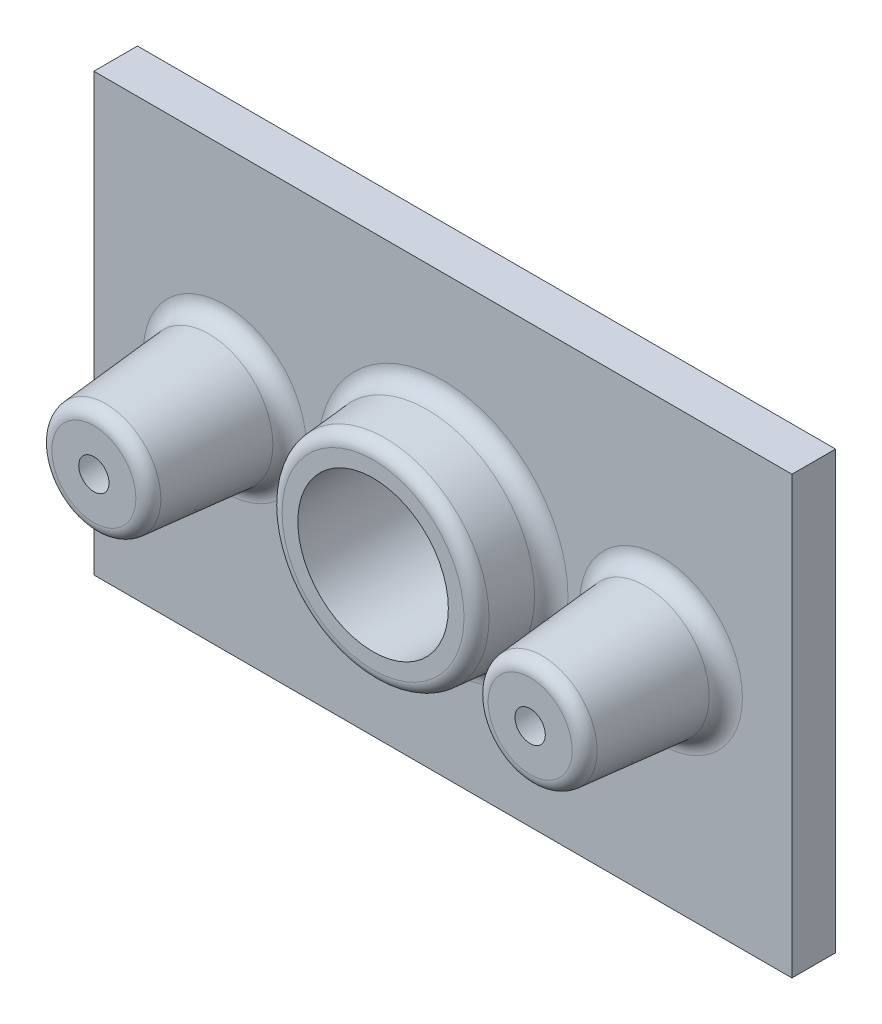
ISO-10303-21;
HEADER;
FILE_DESCRIPTION(('STEP AP214'),'2;1');
FILE_NAME('part.step','',(''),(''),'','','');
FILE_SCHEMA(('AUTOMOTIVE_DESIGN { 1 0 10303 214 1 1 1 1 }'));
ENDSEC;
DATA;
#1=APPLICATION_CONTEXT('core data for automotive mechanical design processes');
#2=APPLICATION_PROTOCOL_DEFINITION('international standard','automotive_design',2000,#1);
#3=PRODUCT_CONTEXT('',#1,'mechanical');
#4=PRODUCT('Part','Part','',(#3));
#5=PRODUCT_RELATED_PRODUCT_CATEGORY('part','',(#4));
#6=PRODUCT_DEFINITION_FORMATION('','',#4);
#7=PRODUCT_DEFINITION_CONTEXT('part definition',#1,'design');
#8=PRODUCT_DEFINITION('design','',#6,#7);
#9=PRODUCT_DEFINITION_SHAPE('','',#8);
#10=(LENGTH_UNIT() NAMED_UNIT(*) SI_UNIT(.MILLI.,.METRE.));
#11=(NAMED_UNIT(*) PLANE_ANGLE_UNIT() SI_UNIT($,.RADIAN.));
#12=(NAMED_UNIT(*) SI_UNIT($,.STERADIAN.) SOLID_ANGLE_UNIT());
#13=UNCERTAINTY_MEASURE_WITH_UNIT(LENGTH_MEASURE(1.E-05),#10,'distance_accuracy_value','');
#14=(GEOMETRIC_REPRESENTATION_CONTEXT(3) GLOBAL_UNCERTAINTY_ASSIGNED_CONTEXT((#13)) GLOBAL_UNIT_ASSIGNED_CONTEXT((#10,
#11,#12)) REPRESENTATION_CONTEXT('',''));
#15=CARTESIAN_POINT('',(0.,0.,0.));
#16=DIRECTION('',(0.,0.,1.));
#17=DIRECTION('',(1.,0.,0.));
#18=AXIS2_PLACEMENT_3D('',#15,#16,#17);
#19=CARTESIAN_POINT('',(-40.,25.,5.));
#20=DIRECTION('',(0.,0.,1.));
#21=DIRECTION('',(1.,0.,0.));
#22=AXIS2_PLACEMENT_3D('',#19,#20,#21);
#23=PLANE('',#22);
#24=CARTESIAN_POINT('',(25.,0.,5.));
#25=DIRECTION('',(0.,0.,1.));
#26=DIRECTION('',(1.,0.,0.));
#27=AXIS2_PLACEMENT_3D('',#24,#25,#26);
#28=CIRCLE('',#27,9.33266234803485);
#29=CARTESIAN_POINT('',(34.3326623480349,0.,5.));
#30=VERTEX_POINT('',#29);
#31=EDGE_CURVE('E318',#30,#30,#28,.F.);
#32=ORIENTED_EDGE('',*,*,#31,.T.);
#33=EDGE_LOOP('',(#32));
#34=FACE_BOUND('',#33,.T.);
#35=CARTESIAN_POINT('',(0.,0.,5.));
#36=DIRECTION('',(0.,0.,1.));
#37=DIRECTION('',(1.,0.,0.));
#38=AXIS2_PLACEMENT_3D('',#35,#36,#37);
#39=CIRCLE('',#38,14.3326623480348);
#40=CARTESIAN_POINT('',(14.3326623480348,0.,5.));
#41=VERTEX_POINT('',#40);
#42=EDGE_CURVE('E315',#41,#41,#39,.F.);
#43=ORIENTED_EDGE('',*,*,#42,.T.);
#44=EDGE_LOOP('',(#43));
#45=FACE_BOUND('',#44,.T.);
#46=CARTESIAN_POINT('',(-25.,0.,5.));
#47=DIRECTION('',(0.,0.,1.));
#48=DIRECTION('',(1.,0.,0.));
#49=AXIS2_PLACEMENT_3D('',#46,#47,#48);
#50=CIRCLE('',#49,9.33266234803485);
#51=CARTESIAN_POINT('',(-15.6673376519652,0.,5.));
#52=VERTEX_POINT('',#51);
#53=EDGE_CURVE('E311',#52,#52,#50,.F.);
#54=ORIENTED_EDGE('',*,*,#53,.T.);
#55=EDGE_LOOP('',(#54));
#56=FACE_BOUND('',#55,.T.);
#57=DIRECTION('',(0.,-1.,0.));
#58=VECTOR('',#57,1.);
#59=CARTESIAN_POINT('',(-40.,25.,5.));
#60=LINE('',#59,#58);
#61=CARTESIAN_POINT('',(-40.,25.,5.));
#62=VERTEX_POINT('',#61);
#63=CARTESIAN_POINT('',(-40.,-25.,5.));
#64=VERTEX_POINT('',#63);
#65=EDGE_CURVE('E593',#62,#64,#60,.T.);
#66=ORIENTED_EDGE('',*,*,#65,.T.);
#67=DIRECTION('',(1.,0.,0.));
#68=VECTOR('',#67,1.);
#69=CARTESIAN_POINT('',(-40.,-25.,5.));
#70=LINE('',#69,#68);
#71=CARTESIAN_POINT('',(40.,-25.,5.));
#72=VERTEX_POINT('',#71);
#73=EDGE_CURVE('E596',#64,#72,#70,.T.);
#74=ORIENTED_EDGE('',*,*,#73,.T.);
#75=DIRECTION('',(0.,1.,0.));
#76=VECTOR('',#75,1.);
#77=CARTESIAN_POINT('',(40.,25.,5.));
#78=LINE('',#77,#76);
#79=CARTESIAN_POINT('',(40.,25.,5.));
#80=VERTEX_POINT('',#79);
#81=EDGE_CURVE('E599',#72,#80,#78,.T.);
#82=ORIENTED_EDGE('',*,*,#81,.T.);
#83=DIRECTION('',(-1.,0.,0.));
#84=VECTOR('',#83,1.);
#85=CARTESIAN_POINT('',(-40.,25.,5.));
#86=LINE('',#85,#84);
#87=EDGE_CURVE('E601',#80,#62,#86,.T.);
#88=ORIENTED_EDGE('',*,*,#87,.T.);
#89=EDGE_LOOP('',(#66,#74,#82,#88));
#90=FACE_BOUND('',#89,.T.);
#91=ADVANCED_FACE('F37',(#34,#45,#56,#90),#23,.T.);
#92=CARTESIAN_POINT('',(-40.,25.,0.));
#93=DIRECTION('',(0.,0.,1.));
#94=DIRECTION('',(1.,0.,0.));
#95=AXIS2_PLACEMENT_3D('',#92,#93,#94);
#96=PLANE('',#95);
#97=DIRECTION('',(-0.916515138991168,-0.4,0.));
#98=VECTOR('',#97,1.);
#99=CARTESIAN_POINT('',(-28.9591716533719,9.0716018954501,0.));
#100=LINE('',#99,#98);
#101=CARTESIAN_POINT('',(-7.9591716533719,18.2367532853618,0.));
#102=VERTEX_POINT('',#101);
#103=CARTESIAN_POINT('',(-28.9591716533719,9.0716018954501,0.));
#104=VERTEX_POINT('',#103);
#105=EDGE_CURVE('E348',#102,#104,#100,.T.);
#106=ORIENTED_EDGE('',*,*,#105,.T.);
#107=CARTESIAN_POINT('',(-25.,0.,0.));
#108=DIRECTION('',(0.,0.,1.));
#109=DIRECTION('',(1.,0.,0.));
#110=AXIS2_PLACEMENT_3D('',#107,#108,#109);
#111=CIRCLE('',#110,9.89792913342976);
#112=CARTESIAN_POINT('',(-28.9591716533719,-9.0716018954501,0.));
#113=VERTEX_POINT('',#112);
#114=EDGE_CURVE('E362',#104,#113,#111,.T.);
#115=ORIENTED_EDGE('',*,*,#114,.T.);
#116=DIRECTION('',(0.916515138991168,-0.4,0.));
#117=VECTOR('',#116,1.);
#118=CARTESIAN_POINT('',(-7.9591716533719,-18.2367532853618,0.));
#119=LINE('',#118,#117);
#120=CARTESIAN_POINT('',(-7.95917165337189,-18.2367532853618,0.));
#121=VERTEX_POINT('',#120);
#122=EDGE_CURVE('E360',#113,#121,#119,.T.);
#123=ORIENTED_EDGE('',*,*,#122,.T.);
#124=CARTESIAN_POINT('',(0.,0.,0.));
#125=DIRECTION('',(0.,0.,1.));
#126=DIRECTION('',(1.,0.,0.));
#127=AXIS2_PLACEMENT_3D('',#124,#125,#126);
#128=CIRCLE('',#127,19.8979291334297);
#129=CARTESIAN_POINT('',(7.9591716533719,-18.2367532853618,0.));
#130=VERTEX_POINT('',#129);
#131=EDGE_CURVE('E358',#121,#130,#128,.T.);
#132=ORIENTED_EDGE('',*,*,#131,.T.);
#133=DIRECTION('',(0.916515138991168,0.4,0.));
#134=VECTOR('',#133,1.);
#135=CARTESIAN_POINT('',(28.9591716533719,-9.07160189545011,0.));
#136=LINE('',#135,#134);
#137=CARTESIAN_POINT('',(28.9591716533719,-9.07160189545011,0.));
#138=VERTEX_POINT('',#137);
#139=EDGE_CURVE('E356',#130,#138,#136,.T.);
#140=ORIENTED_EDGE('',*,*,#139,.T.);
#141=CARTESIAN_POINT('',(25.,0.,0.));
#142=DIRECTION('',(0.,0.,1.));
#143=DIRECTION('',(1.,0.,0.));
#144=AXIS2_PLACEMENT_3D('',#141,#142,#143);
#145=CIRCLE('',#144,9.89792913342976);
#146=CARTESIAN_POINT('',(28.9591716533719,9.0716018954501,0.));
#147=VERTEX_POINT('',#146);
#148=EDGE_CURVE('E354',#138,#147,#145,.T.);
#149=ORIENTED_EDGE('',*,*,#148,.T.);
#150=DIRECTION('',(-0.916515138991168,0.4,0.));
#151=VECTOR('',#150,1.);
#152=CARTESIAN_POINT('',(7.95917165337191,18.2367532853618,0.));
#153=LINE('',#152,#151);
#154=CARTESIAN_POINT('',(7.9591716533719,18.2367532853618,0.));
#155=VERTEX_POINT('',#154);
#156=EDGE_CURVE('E352',#147,#155,#153,.T.);
#157=ORIENTED_EDGE('',*,*,#156,.T.);
#158=CARTESIAN_POINT('',(0.,0.,0.));
#159=DIRECTION('',(0.,0.,1.));
#160=DIRECTION('',(1.,0.,0.));
#161=AXIS2_PLACEMENT_3D('',#158,#159,#160);
#162=CIRCLE('',#161,19.8979291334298);
#163=EDGE_CURVE('E350',#155,#102,#162,.T.);
#164=ORIENTED_EDGE('',*,*,#163,.T.);
#165=EDGE_LOOP('',(#106,#115,#123,#132,#140,#149,#157,#164));
#166=FACE_BOUND('',#165,.T.);
#167=DIRECTION('',(0.,-1.,0.));
#168=VECTOR('',#167,1.);
#169=CARTESIAN_POINT('',(-40.,25.,0.));
#170=LINE('',#169,#168);
#171=CARTESIAN_POINT('',(-40.,25.,0.));
#172=VERTEX_POINT('',#171);
#173=CARTESIAN_POINT('',(-40.,-25.,0.));
#174=VERTEX_POINT('',#173);
#175=EDGE_CURVE('E604',#172,#174,#170,.T.);
#176=ORIENTED_EDGE('',*,*,#175,.F.);
#177=DIRECTION('',(-1.,0.,0.));
#178=VECTOR('',#177,1.);
#179=CARTESIAN_POINT('',(-40.,25.,0.));
#180=LINE('',#179,#178);
#181=CARTESIAN_POINT('',(40.,25.,0.));
#182=VERTEX_POINT('',#181);
#183=EDGE_CURVE('E597',#182,#172,#180,.T.);
#184=ORIENTED_EDGE('',*,*,#183,.F.);
#185=DIRECTION('',(0.,1.,0.));
#186=VECTOR('',#185,1.);
#187=CARTESIAN_POINT('',(40.,25.,0.));
#188=LINE('',#187,#186);
#189=CARTESIAN_POINT('',(40.,-25.,0.));
#190=VERTEX_POINT('',#189);
#191=EDGE_CURVE('E609',#190,#182,#188,.T.);
#192=ORIENTED_EDGE('',*,*,#191,.F.);
#193=DIRECTION('',(1.,0.,0.));
#194=VECTOR('',#193,1.);
#195=CARTESIAN_POINT('',(-40.,-25.,0.));
#196=LINE('',#195,#194);
#197=EDGE_CURVE('E607',#174,#190,#196,.T.);
#198=ORIENTED_EDGE('',*,*,#197,.F.);
#199=EDGE_LOOP('',(#176,#184,#192,#198));
#200=FACE_BOUND('',#199,.T.);
#201=ADVANCED_FACE('F435',(#166,#200),#96,.F.);
#202=CARTESIAN_POINT('',(-40.,25.,5.));
#203=DIRECTION('',(1.,0.,0.));
#204=DIRECTION('',(0.,1.,0.));
#205=AXIS2_PLACEMENT_3D('',#202,#203,#204);
#206=PLANE('',#205);
#207=ORIENTED_EDGE('',*,*,#175,.T.);
#208=DIRECTION('',(0.,0.,-1.));
#209=VECTOR('',#208,1.);
#210=CARTESIAN_POINT('',(-40.,-25.,5.));
#211=LINE('',#210,#209);
#212=EDGE_CURVE('E312',#64,#174,#211,.T.);
#213=ORIENTED_EDGE('',*,*,#212,.F.);
#214=ORIENTED_EDGE('',*,*,#65,.F.);
#215=DIRECTION('',(0.,0.,-1.));
#216=VECTOR('',#215,1.);
#217=CARTESIAN_POINT('',(-40.,25.,5.));
#218=LINE('',#217,#216);
#219=EDGE_CURVE('E603',#62,#172,#218,.T.);
#220=ORIENTED_EDGE('',*,*,#219,.T.);
#221=EDGE_LOOP('',(#207,#213,#214,#220));
#222=FACE_BOUND('',#221,.T.);
#223=ADVANCED_FACE('F441',(#222),#206,.F.);
#224=CARTESIAN_POINT('',(-40.,-25.,5.));
#225=DIRECTION('',(0.,1.,0.));
#226=DIRECTION('',(-1.,0.,0.));
#227=AXIS2_PLACEMENT_3D('',#224,#225,#226);
#228=PLANE('',#227);
#229=ORIENTED_EDGE('',*,*,#197,.T.);
#230=DIRECTION('',(0.,0.,-1.));
#231=VECTOR('',#230,1.);
#232=CARTESIAN_POINT('',(40.,-25.,5.));
#233=LINE('',#232,#231);
#234=EDGE_CURVE('E616',#72,#190,#233,.T.);
#235=ORIENTED_EDGE('',*,*,#234,.F.);
#236=ORIENTED_EDGE('',*,*,#73,.F.);
#237=ORIENTED_EDGE('',*,*,#212,.T.);
#238=EDGE_LOOP('',(#229,#235,#236,#237));
#239=FACE_BOUND('',#238,.T.);
#240=ADVANCED_FACE('F452',(#239),#228,.F.);
#241=CARTESIAN_POINT('',(40.,25.,5.));
#242=DIRECTION('',(-1.,0.,0.));
#243=DIRECTION('',(0.,0.,1.));
#244=AXIS2_PLACEMENT_3D('',#241,#242,#243);
#245=PLANE('',#244);
#246=ORIENTED_EDGE('',*,*,#191,.T.);
#247=DIRECTION('',(0.,0.,-1.));
#248=VECTOR('',#247,1.);
#249=CARTESIAN_POINT('',(40.,25.,5.));
#250=LINE('',#249,#248);
#251=EDGE_CURVE('E614',#80,#182,#250,.T.);
#252=ORIENTED_EDGE('',*,*,#251,.F.);
#253=ORIENTED_EDGE('',*,*,#81,.F.);
#254=ORIENTED_EDGE('',*,*,#234,.T.);
#255=EDGE_LOOP('',(#246,#252,#253,#254));
#256=FACE_BOUND('',#255,.T.);
#257=ADVANCED_FACE('F448',(#256),#245,.F.);
#258=CARTESIAN_POINT('',(-40.,25.,5.));
#259=DIRECTION('',(0.,-1.,0.));
#260=DIRECTION('',(0.,0.,-1.));
#261=AXIS2_PLACEMENT_3D('',#258,#259,#260);
#262=PLANE('',#261);
#263=ORIENTED_EDGE('',*,*,#183,.T.);
#264=ORIENTED_EDGE('',*,*,#219,.F.);
#265=ORIENTED_EDGE('',*,*,#87,.F.);
#266=ORIENTED_EDGE('',*,*,#251,.T.);
#267=EDGE_LOOP('',(#263,#264,#265,#266));
#268=FACE_BOUND('',#267,.T.);
#269=ADVANCED_FACE('F430',(#268),#262,.F.);
#270=CARTESIAN_POINT('',(0.,0.,5.));
#271=DIRECTION('',(0.,0.,-1.));
#272=DIRECTION('',(1.,0.,0.));
#273=AXIS2_PLACEMENT_3D('',#270,#271,#272);
#274=CONICAL_SURFACE('',#273,12.5,0.0872664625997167);
#275=CARTESIAN_POINT('',(0.,0.,11.6307336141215));
#276=DIRECTION('',(0.,0.,-1.));
#277=DIRECTION('',(-1.,0.,0.));
#278=AXIS2_PLACEMENT_3D('',#275,#276,#277);
#279=CIRCLE('',#278,11.9198859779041);
#280=CARTESIAN_POINT('',(-11.9198859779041,0.,11.6307336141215));
#281=VERTEX_POINT('',#280);
#282=EDGE_CURVE('E336',#281,#281,#279,.T.);
#283=ORIENTED_EDGE('',*,*,#282,.T.);
#284=EDGE_LOOP('',(#283));
#285=FACE_BOUND('',#284,.T.);
#286=CARTESIAN_POINT('',(0.,0.,6.82568851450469));
#287=DIRECTION('',(0.,0.,1.));
#288=DIRECTION('',(1.,0.,0.));
#289=AXIS2_PLACEMENT_3D('',#286,#287,#288);
#290=CIRCLE('',#289,12.3402729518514);
#291=CARTESIAN_POINT('',(12.3402729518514,0.,6.82568851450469));
#292=VERTEX_POINT('',#291);
#293=EDGE_CURVE('E321',#292,#292,#290,.T.);
#294=ORIENTED_EDGE('',*,*,#293,.T.);
#295=EDGE_LOOP('',(#294));
#296=FACE_BOUND('',#295,.T.);
#297=ADVANCED_FACE('F421',(#285,#296),#274,.T.);
#298=CARTESIAN_POINT('',(0.,0.,13.));
#299=DIRECTION('',(0.,0.,1.));
#300=DIRECTION('',(1.,0.,0.));
#301=AXIS2_PLACEMENT_3D('',#298,#299,#300);
#302=PLANE('',#301);
#303=CARTESIAN_POINT('',(0.,0.,13.));
#304=DIRECTION('',(0.,0.,1.));
#305=DIRECTION('',(1.,0.,0.));
#306=AXIS2_PLACEMENT_3D('',#303,#304,#305);
#307=CIRCLE('',#306,10.4255939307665);
#308=CARTESIAN_POINT('',(10.4255939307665,0.,13.));
#309=VERTEX_POINT('',#308);
#310=EDGE_CURVE('E333',#309,#309,#307,.T.);
#311=ORIENTED_EDGE('',*,*,#310,.T.);
#312=EDGE_LOOP('',(#311));
#313=FACE_BOUND('',#312,.T.);
#314=CARTESIAN_POINT('',(0.,0.,13.));
#315=DIRECTION('',(0.,0.,1.));
#316=DIRECTION('',(1.,0.,0.));
#317=AXIS2_PLACEMENT_3D('',#314,#315,#316);
#318=CIRCLE('',#317,8.625);
#319=CARTESIAN_POINT('',(8.625,0.,13.));
#320=VERTEX_POINT('',#319);
#321=EDGE_CURVE('E258',#320,#320,#318,.T.);
#322=ORIENTED_EDGE('',*,*,#321,.F.);
#323=EDGE_LOOP('',(#322));
#324=FACE_BOUND('',#323,.T.);
#325=ADVANCED_FACE('F418',(#313,#324),#302,.T.);
#326=CARTESIAN_POINT('',(0.,0.,0.));
#327=DIRECTION('',(0.,0.,1.));
#328=DIRECTION('',(-1.,0.,0.));
#329=AXIS2_PLACEMENT_3D('',#326,#327,#328);
#330=CONICAL_SURFACE('',#329,18.,0.05235987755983);
#331=DIRECTION('',(-0.0209343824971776,0.0479666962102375,0.998629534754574));
#332=VECTOR('',#331,1.);
#333=CARTESIAN_POINT('',(-7.2,16.497272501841,0.));
#334=LINE('',#333,#332);
#335=CARTESIAN_POINT('',(-7.13711066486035,16.3531749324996,-3.));
#336=VERTEX_POINT('',#335);
#337=CARTESIAN_POINT('',(-7.16026802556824,16.4062351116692,-1.89532808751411));
#338=VERTEX_POINT('',#337);
#339=EDGE_CURVE('E592',#336,#338,#334,.T.);
#340=ORIENTED_EDGE('',*,*,#339,.T.);
#341=CARTESIAN_POINT('',(0.,0.,-1.89532808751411));
#342=DIRECTION('',(0.,0.,1.));
#343=DIRECTION('',(1.,0.,0.));
#344=AXIS2_PLACEMENT_3D('',#341,#342,#343);
#345=CIRCLE('',#344,17.9006700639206);
#346=CARTESIAN_POINT('',(7.16026802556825,16.4062351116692,-1.89532808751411));
#347=VERTEX_POINT('',#346);
#348=EDGE_CURVE('E61',#338,#347,#345,.F.);
#349=ORIENTED_EDGE('',*,*,#348,.T.);
#350=DIRECTION('',(0.0209343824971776,0.0479666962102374,0.998629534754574));
#351=VECTOR('',#350,1.);
#352=CARTESIAN_POINT('',(7.2,16.497272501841,0.));
#353=LINE('',#352,#351);
#354=CARTESIAN_POINT('',(7.13711066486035,16.3531749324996,-3.));
#355=VERTEX_POINT('',#354);
#356=EDGE_CURVE('E563',#355,#347,#353,.T.);
#357=ORIENTED_EDGE('',*,*,#356,.F.);
#358=CARTESIAN_POINT('',(0.,0.,-3.));
#359=DIRECTION('',(0.,0.,-1.));
#360=DIRECTION('',(-1.,0.,0.));
#361=AXIS2_PLACEMENT_3D('',#358,#359,#360);
#362=CIRCLE('',#361,17.8427766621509);
#363=EDGE_CURVE('E564',#336,#355,#362,.T.);
#364=ORIENTED_EDGE('',*,*,#363,.F.);
#365=EDGE_LOOP('',(#340,#349,#357,#364));
#366=FACE_BOUND('',#365,.T.);
#367=ADVANCED_FACE('F420',(#366),#330,.T.);
#368=CARTESIAN_POINT('',(28.2,7.33212111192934,0.));
#369=DIRECTION('',(0.39945181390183,0.915259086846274,-0.0523359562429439));
#370=DIRECTION('',(-0.916515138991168,0.4,0.));
#371=AXIS2_PLACEMENT_3D('',#368,#369,#370);
#372=PLANE('',#371);
#373=ORIENTED_EDGE('',*,*,#356,.T.);
#374=DIRECTION('',(0.916515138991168,-0.4,0.));
#375=VECTOR('',#374,1.);
#376=CARTESIAN_POINT('',(28.1602680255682,7.24108372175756,-1.89532808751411));
#377=LINE('',#376,#375);
#378=CARTESIAN_POINT('',(28.1602680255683,7.24108372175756,-1.89532808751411));
#379=VERTEX_POINT('',#378);
#380=EDGE_CURVE('E373',#347,#379,#377,.T.);
#381=ORIENTED_EDGE('',*,*,#380,.T.);
#382=DIRECTION('',(0.0209343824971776,0.0479666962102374,0.998629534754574));
#383=VECTOR('',#382,1.);
#384=CARTESIAN_POINT('',(28.2,7.33212111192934,0.));
#385=LINE('',#384,#383);
#386=CARTESIAN_POINT('',(28.1371106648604,7.1880235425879,-3.));
#387=VERTEX_POINT('',#386);
#388=EDGE_CURVE('E560',#387,#379,#385,.T.);
#389=ORIENTED_EDGE('',*,*,#388,.F.);
#390=DIRECTION('',(0.916515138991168,-0.4,0.));
#391=VECTOR('',#390,1.);
#392=CARTESIAN_POINT('',(23.5339363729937,9.19701350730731,-3.));
#393=LINE('',#392,#391);
#394=CARTESIAN_POINT('',(23.5339363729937,9.19701350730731,-3.));
#395=VERTEX_POINT('',#394);
#396=EDGE_CURVE('E278',#395,#387,#393,.T.);
#397=ORIENTED_EDGE('',*,*,#396,.F.);
#398=DIRECTION('',(-0.916515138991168,0.4,0.));
#399=VECTOR('',#398,1.);
#400=CARTESIAN_POINT('',(28.1371106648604,7.1880235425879,-3.));
#401=LINE('',#400,#399);
#402=EDGE_CURVE('E567',#355,#395,#401,.F.);
#403=ORIENTED_EDGE('',*,*,#402,.F.);
#404=EDGE_LOOP('',(#373,#381,#389,#397,#403));
#405=FACE_BOUND('',#404,.T.);
#406=ADVANCED_FACE('F428',(#405),#372,.T.);
#407=CARTESIAN_POINT('',(25.,0.,0.));
#408=DIRECTION('',(0.,0.,1.));
#409=DIRECTION('',(-1.,0.,0.));
#410=AXIS2_PLACEMENT_3D('',#407,#408,#409);
#411=CONICAL_SURFACE('',#410,8.,0.05235987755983);
#412=ORIENTED_EDGE('',*,*,#388,.T.);
#413=CARTESIAN_POINT('',(25.,0.,-1.89532808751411));
#414=DIRECTION('',(0.,0.,1.));
#415=DIRECTION('',(1.,0.,0.));
#416=AXIS2_PLACEMENT_3D('',#413,#414,#415);
#417=CIRCLE('',#416,7.90067006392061);
#418=CARTESIAN_POINT('',(28.1602680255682,-7.24108372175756,-1.89532808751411));
#419=VERTEX_POINT('',#418);
#420=EDGE_CURVE('E371',#379,#419,#417,.F.);
#421=ORIENTED_EDGE('',*,*,#420,.T.);
#422=DIRECTION('',(0.0209343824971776,-0.0479666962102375,0.998629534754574));
#423=VECTOR('',#422,1.);
#424=CARTESIAN_POINT('',(28.2,-7.33212111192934,0.));
#425=LINE('',#424,#423);
#426=CARTESIAN_POINT('',(28.1371106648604,-7.1880235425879,-3.));
#427=VERTEX_POINT('',#426);
#428=EDGE_CURVE('E552',#427,#419,#425,.T.);
#429=ORIENTED_EDGE('',*,*,#428,.F.);
#430=CARTESIAN_POINT('',(25.,0.,-3.));
#431=DIRECTION('',(0.,0.,-1.));
#432=DIRECTION('',(-1.,0.,0.));
#433=AXIS2_PLACEMENT_3D('',#430,#431,#432);
#434=CIRCLE('',#433,7.84277666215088);
#435=EDGE_CURVE('E571',#387,#427,#434,.T.);
#436=ORIENTED_EDGE('',*,*,#435,.F.);
#437=EDGE_LOOP('',(#412,#421,#429,#436));
#438=FACE_BOUND('',#437,.T.);
#439=ADVANCED_FACE('F664',(#438),#411,.T.);
#440=CARTESIAN_POINT('',(28.2,-7.33212111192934,0.));
#441=DIRECTION('',(0.399451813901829,-0.915259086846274,-0.0523359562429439));
#442=DIRECTION('',(0.916515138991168,0.4,0.));
#443=AXIS2_PLACEMENT_3D('',#440,#441,#442);
#444=PLANE('',#443);
#445=ORIENTED_EDGE('',*,*,#428,.T.);
#446=DIRECTION('',(-0.916515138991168,-0.4,0.));
#447=VECTOR('',#446,1.);
#448=CARTESIAN_POINT('',(7.16026802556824,-16.4062351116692,-1.89532808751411));
#449=LINE('',#448,#447);
#450=CARTESIAN_POINT('',(7.16026802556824,-16.4062351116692,-1.89532808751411));
#451=VERTEX_POINT('',#450);
#452=EDGE_CURVE('E369',#419,#451,#449,.T.);
#453=ORIENTED_EDGE('',*,*,#452,.T.);
#454=DIRECTION('',(0.0209343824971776,-0.0479666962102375,0.998629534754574));
#455=VECTOR('',#454,1.);
#456=CARTESIAN_POINT('',(7.19999999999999,-16.497272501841,0.));
#457=LINE('',#456,#455);
#458=CARTESIAN_POINT('',(7.13711066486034,-16.3531749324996,-3.));
#459=VERTEX_POINT('',#458);
#460=EDGE_CURVE('E543',#459,#451,#457,.T.);
#461=ORIENTED_EDGE('',*,*,#460,.F.);
#462=DIRECTION('',(0.916515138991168,0.4,0.));
#463=VECTOR('',#462,1.);
#464=CARTESIAN_POINT('',(28.1371106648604,-7.1880235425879,-3.));
#465=LINE('',#464,#463);
#466=CARTESIAN_POINT('',(23.5339363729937,-9.1970135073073,-3.));
#467=VERTEX_POINT('',#466);
#468=EDGE_CURVE('E578',#467,#459,#465,.F.);
#469=ORIENTED_EDGE('',*,*,#468,.F.);
#470=EDGE_CURVE('E580',#427,#467,#465,.F.);
#471=ORIENTED_EDGE('',*,*,#470,.F.);
#472=EDGE_LOOP('',(#445,#453,#461,#469,#471));
#473=FACE_BOUND('',#472,.T.);
#474=ADVANCED_FACE('F660',(#473),#444,.T.);
#475=CARTESIAN_POINT('',(0.,0.,0.));
#476=DIRECTION('',(0.,0.,1.));
#477=DIRECTION('',(-1.,0.,0.));
#478=AXIS2_PLACEMENT_3D('',#475,#476,#477);
#479=CONICAL_SURFACE('',#478,18.,0.05235987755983);
#480=ORIENTED_EDGE('',*,*,#460,.T.);
#481=CARTESIAN_POINT('',(0.,0.,-1.89532808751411));
#482=DIRECTION('',(0.,0.,1.));
#483=DIRECTION('',(1.,0.,0.));
#484=AXIS2_PLACEMENT_3D('',#481,#482,#483);
#485=CIRCLE('',#484,17.9006700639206);
#486=CARTESIAN_POINT('',(-7.16026802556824,-16.4062351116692,-1.89532808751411));
#487=VERTEX_POINT('',#486);
#488=EDGE_CURVE('E367',#451,#487,#485,.F.);
#489=ORIENTED_EDGE('',*,*,#488,.T.);
#490=DIRECTION('',(-0.0209343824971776,-0.0479666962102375,0.998629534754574));
#491=VECTOR('',#490,1.);
#492=CARTESIAN_POINT('',(-7.19999999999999,-16.497272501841,0.));
#493=LINE('',#492,#491);
#494=CARTESIAN_POINT('',(-7.13711066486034,-16.3531749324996,-3.));
#495=VERTEX_POINT('',#494);
#496=EDGE_CURVE('E540',#495,#487,#493,.T.);
#497=ORIENTED_EDGE('',*,*,#496,.F.);
#498=CARTESIAN_POINT('',(0.,0.,-3.));
#499=DIRECTION('',(0.,0.,-1.));
#500=DIRECTION('',(-1.,0.,0.));
#501=AXIS2_PLACEMENT_3D('',#498,#499,#500);
#502=CIRCLE('',#501,17.8427766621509);
#503=EDGE_CURVE('E584',#459,#495,#502,.T.);
#504=ORIENTED_EDGE('',*,*,#503,.F.);
#505=EDGE_LOOP('',(#480,#489,#497,#504));
#506=FACE_BOUND('',#505,.T.);
#507=ADVANCED_FACE('F538',(#506),#479,.T.);
#508=CARTESIAN_POINT('',(-7.19999999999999,-16.497272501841,0.));
#509=DIRECTION('',(-0.399451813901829,-0.915259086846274,-0.0523359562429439));
#510=DIRECTION('',(0.916515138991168,-0.4,0.));
#511=AXIS2_PLACEMENT_3D('',#508,#509,#510);
#512=PLANE('',#511);
#513=ORIENTED_EDGE('',*,*,#496,.T.);
#514=DIRECTION('',(-0.916515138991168,0.4,0.));
#515=VECTOR('',#514,1.);
#516=CARTESIAN_POINT('',(-28.1602680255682,-7.24108372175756,-1.89532808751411));
#517=LINE('',#516,#515);
#518=CARTESIAN_POINT('',(-28.1602680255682,-7.24108372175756,-1.89532808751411));
#519=VERTEX_POINT('',#518);
#520=EDGE_CURVE('E365',#487,#519,#517,.T.);
#521=ORIENTED_EDGE('',*,*,#520,.T.);
#522=DIRECTION('',(-0.0209343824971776,-0.0479666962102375,0.998629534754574));
#523=VECTOR('',#522,1.);
#524=CARTESIAN_POINT('',(-28.2,-7.33212111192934,0.));
#525=LINE('',#524,#523);
#526=CARTESIAN_POINT('',(-28.1371106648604,-7.1880235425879,-3.));
#527=VERTEX_POINT('',#526);
#528=EDGE_CURVE('E550',#527,#519,#525,.T.);
#529=ORIENTED_EDGE('',*,*,#528,.F.);
#530=DIRECTION('',(0.916515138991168,-0.399999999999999,0.));
#531=VECTOR('',#530,1.);
#532=CARTESIAN_POINT('',(-28.1371106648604,-7.1880235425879,-3.));
#533=LINE('',#532,#531);
#534=CARTESIAN_POINT('',(-23.5339363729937,-9.1970135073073,-3.));
#535=VERTEX_POINT('',#534);
#536=EDGE_CURVE('E238',#527,#535,#533,.T.);
#537=ORIENTED_EDGE('',*,*,#536,.T.);
#538=DIRECTION('',(0.916515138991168,-0.4,0.));
#539=VECTOR('',#538,1.);
#540=CARTESIAN_POINT('',(-7.13711066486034,-16.3531749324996,-3.));
#541=LINE('',#540,#539);
#542=EDGE_CURVE('E549',#495,#535,#541,.F.);
#543=ORIENTED_EDGE('',*,*,#542,.F.);
#544=EDGE_LOOP('',(#513,#521,#529,#537,#543));
#545=FACE_BOUND('',#544,.T.);
#546=ADVANCED_FACE('F545',(#545),#512,.T.);
#547=CARTESIAN_POINT('',(-25.,0.,0.));
#548=DIRECTION('',(0.,0.,1.));
#549=DIRECTION('',(-1.,0.,0.));
#550=AXIS2_PLACEMENT_3D('',#547,#548,#549);
#551=CONICAL_SURFACE('',#550,7.99999999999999,0.05235987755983);
#552=ORIENTED_EDGE('',*,*,#528,.T.);
#553=CARTESIAN_POINT('',(-25.,0.,-1.89532808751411));
#554=DIRECTION('',(0.,0.,1.));
#555=DIRECTION('',(1.,0.,0.));
#556=AXIS2_PLACEMENT_3D('',#553,#554,#555);
#557=CIRCLE('',#556,7.90067006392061);
#558=CARTESIAN_POINT('',(-28.1602680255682,7.24108372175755,-1.89532808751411));
#559=VERTEX_POINT('',#558);
#560=EDGE_CURVE('E345',#519,#559,#557,.F.);
#561=ORIENTED_EDGE('',*,*,#560,.T.);
#562=DIRECTION('',(-0.0209343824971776,0.0479666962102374,0.998629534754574));
#563=VECTOR('',#562,1.);
#564=CARTESIAN_POINT('',(-28.2,7.33212111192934,0.));
#565=LINE('',#564,#563);
#566=CARTESIAN_POINT('',(-28.1371106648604,7.18802354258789,-3.));
#567=VERTEX_POINT('',#566);
#568=EDGE_CURVE('E554',#567,#559,#565,.T.);
#569=ORIENTED_EDGE('',*,*,#568,.F.);
#570=CARTESIAN_POINT('',(-25.,0.,-3.));
#571=DIRECTION('',(0.,0.,-1.));
#572=DIRECTION('',(-1.,0.,0.));
#573=AXIS2_PLACEMENT_3D('',#570,#571,#572);
#574=CIRCLE('',#573,7.84277666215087);
#575=EDGE_CURVE('E222',#527,#567,#574,.T.);
#576=ORIENTED_EDGE('',*,*,#575,.F.);
#577=EDGE_LOOP('',(#552,#561,#569,#576));
#578=FACE_BOUND('',#577,.T.);
#579=ADVANCED_FACE('F639',(#578),#551,.T.);
#580=CARTESIAN_POINT('',(-7.2,16.497272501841,0.));
#581=DIRECTION('',(-0.39945181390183,0.915259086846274,-0.0523359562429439));
#582=DIRECTION('',(-0.916515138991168,-0.4,0.));
#583=AXIS2_PLACEMENT_3D('',#580,#581,#582);
#584=PLANE('',#583);
#585=ORIENTED_EDGE('',*,*,#568,.T.);
#586=DIRECTION('',(0.916515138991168,0.4,0.));
#587=VECTOR('',#586,1.);
#588=CARTESIAN_POINT('',(-7.16026802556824,16.4062351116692,-1.89532808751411));
#589=LINE('',#588,#587);
#590=EDGE_CURVE('E54',#559,#338,#589,.T.);
#591=ORIENTED_EDGE('',*,*,#590,.T.);
#592=ORIENTED_EDGE('',*,*,#339,.F.);
#593=DIRECTION('',(-0.916515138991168,-0.4,0.));
#594=VECTOR('',#593,1.);
#595=CARTESIAN_POINT('',(-7.13711066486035,16.3531749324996,-3.));
#596=LINE('',#595,#594);
#597=CARTESIAN_POINT('',(-23.5339363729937,9.1970135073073,-3.));
#598=VERTEX_POINT('',#597);
#599=EDGE_CURVE('E589',#598,#336,#596,.F.);
#600=ORIENTED_EDGE('',*,*,#599,.F.);
#601=EDGE_CURVE('E590',#567,#598,#596,.F.);
#602=ORIENTED_EDGE('',*,*,#601,.F.);
#603=EDGE_LOOP('',(#585,#591,#592,#600,#602));
#604=FACE_BOUND('',#603,.T.);
#605=ADVANCED_FACE('F636',(#604),#584,.T.);
#606=CARTESIAN_POINT('',(0.,0.,-3.));
#607=DIRECTION('',(0.,0.,-1.));
#608=DIRECTION('',(-1.,0.,0.));
#609=AXIS2_PLACEMENT_3D('',#606,#607,#608);
#610=PLANE('',#609);
#611=CARTESIAN_POINT('',(0.,0.,-3.));
#612=DIRECTION('',(0.,0.,-1.));
#613=DIRECTION('',(-1.,0.,0.));
#614=AXIS2_PLACEMENT_3D('',#611,#612,#613);
#615=CIRCLE('',#614,9.12499999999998);
#616=CARTESIAN_POINT('',(-9.12499999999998,0.,-3.));
#617=VERTEX_POINT('',#616);
#618=EDGE_CURVE('E11',#617,#617,#615,.F.);
#619=ORIENTED_EDGE('',*,*,#618,.T.);
#620=EDGE_LOOP('',(#619));
#621=FACE_BOUND('',#620,.T.);
#622=DIRECTION('',(-0.633373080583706,0.773846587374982,0.));
#623=VECTOR('',#622,1.);
#624=CARTESIAN_POINT('',(-19.1040975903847,3.78469692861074,-3.));
#625=LINE('',#624,#623);
#626=CARTESIAN_POINT('',(-19.1040975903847,3.78469692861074,-3.));
#627=VERTEX_POINT('',#626);
#628=EDGE_CURVE('E255',#627,#598,#625,.T.);
#629=ORIENTED_EDGE('',*,*,#628,.T.);
#630=ORIENTED_EDGE('',*,*,#599,.T.);
#631=ORIENTED_EDGE('',*,*,#363,.T.);
#632=ORIENTED_EDGE('',*,*,#402,.T.);
#633=DIRECTION('',(0.633373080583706,0.773846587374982,0.));
#634=VECTOR('',#633,1.);
#635=CARTESIAN_POINT('',(19.1040975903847,3.78469692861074,-3.));
#636=LINE('',#635,#634);
#637=CARTESIAN_POINT('',(19.1040975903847,3.78469692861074,-3.));
#638=VERTEX_POINT('',#637);
#639=EDGE_CURVE('E292',#638,#395,#636,.T.);
#640=ORIENTED_EDGE('',*,*,#639,.F.);
#641=DIRECTION('',(0.,1.,0.));
#642=VECTOR('',#641,1.);
#643=CARTESIAN_POINT('',(19.1040975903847,-3.78469692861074,-3.));
#644=LINE('',#643,#642);
#645=CARTESIAN_POINT('',(19.1040975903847,-3.78469692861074,-3.));
#646=VERTEX_POINT('',#645);
#647=EDGE_CURVE('E289',#646,#638,#644,.T.);
#648=ORIENTED_EDGE('',*,*,#647,.F.);
#649=DIRECTION('',(-0.633373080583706,0.773846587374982,0.));
#650=VECTOR('',#649,1.);
#651=CARTESIAN_POINT('',(23.5339363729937,-9.1970135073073,-3.));
#652=LINE('',#651,#650);
#653=EDGE_CURVE('E226',#467,#646,#652,.T.);
#654=ORIENTED_EDGE('',*,*,#653,.F.);
#655=ORIENTED_EDGE('',*,*,#468,.T.);
#656=ORIENTED_EDGE('',*,*,#503,.T.);
#657=ORIENTED_EDGE('',*,*,#542,.T.);
#658=DIRECTION('',(0.633373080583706,0.773846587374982,0.));
#659=VECTOR('',#658,1.);
#660=CARTESIAN_POINT('',(-23.5339363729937,-9.1970135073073,-3.));
#661=LINE('',#660,#659);
#662=CARTESIAN_POINT('',(-19.1040975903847,-3.78469692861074,-3.));
#663=VERTEX_POINT('',#662);
#664=EDGE_CURVE('E260',#535,#663,#661,.T.);
#665=ORIENTED_EDGE('',*,*,#664,.T.);
#666=DIRECTION('',(0.,1.,0.));
#667=VECTOR('',#666,1.);
#668=CARTESIAN_POINT('',(-19.1040975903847,-3.78469692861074,-3.));
#669=LINE('',#668,#667);
#670=EDGE_CURVE('E257',#663,#627,#669,.T.);
#671=ORIENTED_EDGE('',*,*,#670,.T.);
#672=EDGE_LOOP('',(#629,#630,#631,#632,#640,#648,#654,#655,#656,#657,#665,#671));
#673=FACE_BOUND('',#672,.T.);
#674=ADVANCED_FACE('F654',(#621,#673),#610,.T.);
#675=CARTESIAN_POINT('',(25.,0.,-6.));
#676=DIRECTION('',(0.,0.,1.));
#677=DIRECTION('',(1.,0.,0.));
#678=AXIS2_PLACEMENT_3D('',#675,#676,#677);
#679=CYLINDRICAL_SURFACE('',#678,7.84277666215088);
#680=ORIENTED_EDGE('',*,*,#435,.T.);
#681=DIRECTION('',(0.,0.,1.));
#682=VECTOR('',#681,1.);
#683=CARTESIAN_POINT('',(28.1371106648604,-7.1880235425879,-6.));
#684=LINE('',#683,#682);
#685=CARTESIAN_POINT('',(28.1371106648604,-7.1880235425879,-6.));
#686=VERTEX_POINT('',#685);
#687=EDGE_CURVE('E568',#686,#427,#684,.T.);
#688=ORIENTED_EDGE('',*,*,#687,.F.);
#689=CARTESIAN_POINT('',(25.,0.,-6.));
#690=DIRECTION('',(0.,0.,-1.));
#691=DIRECTION('',(-1.,0.,0.));
#692=AXIS2_PLACEMENT_3D('',#689,#690,#691);
#693=CIRCLE('',#692,7.84277666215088);
#694=CARTESIAN_POINT('',(28.1371106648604,7.1880235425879,-6.));
#695=VERTEX_POINT('',#694);
#696=EDGE_CURVE('E274',#695,#686,#693,.T.);
#697=ORIENTED_EDGE('',*,*,#696,.F.);
#698=DIRECTION('',(0.,0.,1.));
#699=VECTOR('',#698,1.);
#700=CARTESIAN_POINT('',(28.1371106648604,7.1880235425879,-6.));
#701=LINE('',#700,#699);
#702=EDGE_CURVE('E288',#695,#387,#701,.T.);
#703=ORIENTED_EDGE('',*,*,#702,.T.);
#704=EDGE_LOOP('',(#680,#688,#697,#703));
#705=FACE_BOUND('',#704,.T.);
#706=ADVANCED_FACE('F708',(#705),#679,.T.);
#707=CARTESIAN_POINT('',(28.1371106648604,-7.1880235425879,-6.));
#708=DIRECTION('',(-0.399999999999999,0.916515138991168,0.));
#709=DIRECTION('',(-0.916515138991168,-0.399999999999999,0.));
#710=AXIS2_PLACEMENT_3D('',#707,#708,#709);
#711=PLANE('',#710);
#712=ORIENTED_EDGE('',*,*,#470,.T.);
#713=DIRECTION('',(0.,0.,1.));
#714=VECTOR('',#713,1.);
#715=CARTESIAN_POINT('',(23.5339363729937,-9.1970135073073,-6.));
#716=LINE('',#715,#714);
#717=CARTESIAN_POINT('',(23.5339363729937,-9.1970135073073,-6.));
#718=VERTEX_POINT('',#717);
#719=EDGE_CURVE('E690',#718,#467,#716,.T.);
#720=ORIENTED_EDGE('',*,*,#719,.F.);
#721=DIRECTION('',(-0.916515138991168,-0.399999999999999,0.));
#722=VECTOR('',#721,1.);
#723=CARTESIAN_POINT('',(28.1371106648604,-7.1880235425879,-6.));
#724=LINE('',#723,#722);
#725=EDGE_CURVE('E277',#686,#718,#724,.T.);
#726=ORIENTED_EDGE('',*,*,#725,.F.);
#727=ORIENTED_EDGE('',*,*,#687,.T.);
#728=EDGE_LOOP('',(#712,#720,#726,#727));
#729=FACE_BOUND('',#728,.T.);
#730=ADVANCED_FACE('F701',(#729),#711,.F.);
#731=CARTESIAN_POINT('',(23.5339363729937,-9.1970135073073,-6.));
#732=DIRECTION('',(0.773846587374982,0.633373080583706,0.));
#733=DIRECTION('',(-0.633373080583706,0.773846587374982,0.));
#734=AXIS2_PLACEMENT_3D('',#731,#732,#733);
#735=PLANE('',#734);
#736=ORIENTED_EDGE('',*,*,#653,.T.);
#737=DIRECTION('',(0.,0.,1.));
#738=VECTOR('',#737,1.);
#739=CARTESIAN_POINT('',(19.1040975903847,-3.78469692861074,-6.));
#740=LINE('',#739,#738);
#741=CARTESIAN_POINT('',(19.1040975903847,-3.78469692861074,-6.));
#742=VERTEX_POINT('',#741);
#743=EDGE_CURVE('E689',#742,#646,#740,.T.);
#744=ORIENTED_EDGE('',*,*,#743,.F.);
#745=DIRECTION('',(-0.633373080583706,0.773846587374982,0.));
#746=VECTOR('',#745,1.);
#747=CARTESIAN_POINT('',(23.5339363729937,-9.1970135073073,-6.));
#748=LINE('',#747,#746);
#749=EDGE_CURVE('E280',#718,#742,#748,.T.);
#750=ORIENTED_EDGE('',*,*,#749,.F.);
#751=ORIENTED_EDGE('',*,*,#719,.T.);
#752=EDGE_LOOP('',(#736,#744,#750,#751));
#753=FACE_BOUND('',#752,.T.);
#754=ADVANCED_FACE('F699',(#753),#735,.F.);
#755=CARTESIAN_POINT('',(19.1040975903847,-3.78469692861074,-6.));
#756=DIRECTION('',(1.,0.,0.));
#757=DIRECTION('',(0.,0.,-1.));
#758=AXIS2_PLACEMENT_3D('',#755,#756,#757);
#759=PLANE('',#758);
#760=ORIENTED_EDGE('',*,*,#647,.T.);
#761=DIRECTION('',(0.,0.,1.));
#762=VECTOR('',#761,1.);
#763=CARTESIAN_POINT('',(19.1040975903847,3.78469692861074,-6.));
#764=LINE('',#763,#762);
#765=CARTESIAN_POINT('',(19.1040975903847,3.78469692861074,-6.));
#766=VERTEX_POINT('',#765);
#767=EDGE_CURVE('E305',#766,#638,#764,.T.);
#768=ORIENTED_EDGE('',*,*,#767,.F.);
#769=DIRECTION('',(0.,1.,0.));
#770=VECTOR('',#769,1.);
#771=CARTESIAN_POINT('',(19.1040975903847,-3.78469692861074,-6.));
#772=LINE('',#771,#770);
#773=EDGE_CURVE('E282',#742,#766,#772,.T.);
#774=ORIENTED_EDGE('',*,*,#773,.F.);
#775=ORIENTED_EDGE('',*,*,#743,.T.);
#776=EDGE_LOOP('',(#760,#768,#774,#775));
#777=FACE_BOUND('',#776,.T.);
#778=ADVANCED_FACE('F688',(#777),#759,.F.);
#779=CARTESIAN_POINT('',(19.1040975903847,3.78469692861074,-6.));
#780=DIRECTION('',(0.773846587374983,-0.633373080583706,0.));
#781=DIRECTION('',(0.633373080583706,0.773846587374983,0.));
#782=AXIS2_PLACEMENT_3D('',#779,#780,#781);
#783=PLANE('',#782);
#784=ORIENTED_EDGE('',*,*,#639,.T.);
#785=DIRECTION('',(0.,0.,1.));
#786=VECTOR('',#785,1.);
#787=CARTESIAN_POINT('',(23.5339363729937,9.19701350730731,-6.));
#788=LINE('',#787,#786);
#789=CARTESIAN_POINT('',(23.5339363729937,9.19701350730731,-6.));
#790=VERTEX_POINT('',#789);
#791=EDGE_CURVE('E302',#790,#395,#788,.T.);
#792=ORIENTED_EDGE('',*,*,#791,.F.);
#793=DIRECTION('',(0.633373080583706,0.773846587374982,0.));
#794=VECTOR('',#793,1.);
#795=CARTESIAN_POINT('',(19.1040975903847,3.78469692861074,-6.));
#796=LINE('',#795,#794);
#797=EDGE_CURVE('E284',#766,#790,#796,.T.);
#798=ORIENTED_EDGE('',*,*,#797,.F.);
#799=ORIENTED_EDGE('',*,*,#767,.T.);
#800=EDGE_LOOP('',(#784,#792,#798,#799));
#801=FACE_BOUND('',#800,.T.);
#802=ADVANCED_FACE('F674',(#801),#783,.F.);
#803=CARTESIAN_POINT('',(23.5339363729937,9.19701350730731,-6.));
#804=DIRECTION('',(-0.4,-0.916515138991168,0.));
#805=DIRECTION('',(0.916515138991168,-0.4,0.));
#806=AXIS2_PLACEMENT_3D('',#803,#804,#805);
#807=PLANE('',#806);
#808=ORIENTED_EDGE('',*,*,#396,.T.);
#809=ORIENTED_EDGE('',*,*,#702,.F.);
#810=DIRECTION('',(0.916515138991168,-0.4,0.));
#811=VECTOR('',#810,1.);
#812=CARTESIAN_POINT('',(23.5339363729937,9.19701350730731,-6.));
#813=LINE('',#812,#811);
#814=EDGE_CURVE('E286',#790,#695,#813,.T.);
#815=ORIENTED_EDGE('',*,*,#814,.F.);
#816=ORIENTED_EDGE('',*,*,#791,.T.);
#817=EDGE_LOOP('',(#808,#809,#815,#816));
#818=FACE_BOUND('',#817,.T.);
#819=ADVANCED_FACE('F678',(#818),#807,.F.);
#820=CARTESIAN_POINT('',(25.,0.,-6.));
#821=DIRECTION('',(0.,0.,-1.));
#822=DIRECTION('',(-1.,0.,0.));
#823=AXIS2_PLACEMENT_3D('',#820,#821,#822);
#824=PLANE('',#823);
#825=CARTESIAN_POINT('',(25.,0.,-6.));
#826=DIRECTION('',(0.,0.,-1.));
#827=DIRECTION('',(-1.,0.,0.));
#828=AXIS2_PLACEMENT_3D('',#825,#826,#827);
#829=CIRCLE('',#828,3.39999999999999);
#830=CARTESIAN_POINT('',(21.6,0.,-6.));
#831=VERTEX_POINT('',#830);
#832=EDGE_CURVE('E406',#831,#831,#829,.T.);
#833=ORIENTED_EDGE('',*,*,#832,.F.);
#834=EDGE_LOOP('',(#833));
#835=FACE_BOUND('',#834,.T.);
#836=ORIENTED_EDGE('',*,*,#696,.T.);
#837=ORIENTED_EDGE('',*,*,#725,.T.);
#838=ORIENTED_EDGE('',*,*,#749,.T.);
#839=ORIENTED_EDGE('',*,*,#773,.T.);
#840=ORIENTED_EDGE('',*,*,#797,.T.);
#841=ORIENTED_EDGE('',*,*,#814,.T.);
#842=EDGE_LOOP('',(#836,#837,#838,#839,#840,#841));
#843=FACE_BOUND('',#842,.T.);
#844=ADVANCED_FACE('F681',(#835,#843),#824,.T.);
#845=CARTESIAN_POINT('',(-25.,0.,-6.));
#846=DIRECTION('',(0.,0.,1.));
#847=DIRECTION('',(1.,0.,0.));
#848=AXIS2_PLACEMENT_3D('',#845,#846,#847);
#849=CYLINDRICAL_SURFACE('',#848,7.84277666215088);
#850=ORIENTED_EDGE('',*,*,#575,.T.);
#851=DIRECTION('',(0.,0.,1.));
#852=VECTOR('',#851,1.);
#853=CARTESIAN_POINT('',(-28.1371106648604,7.1880235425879,-6.));
#854=LINE('',#853,#852);
#855=CARTESIAN_POINT('',(-28.1371106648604,7.1880235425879,-6.));
#856=VERTEX_POINT('',#855);
#857=EDGE_CURVE('E216',#856,#567,#854,.T.);
#858=ORIENTED_EDGE('',*,*,#857,.F.);
#859=CARTESIAN_POINT('',(-25.,0.,-6.));
#860=DIRECTION('',(0.,0.,1.));
#861=DIRECTION('',(1.,0.,0.));
#862=AXIS2_PLACEMENT_3D('',#859,#860,#861);
#863=CIRCLE('',#862,7.84277666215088);
#864=CARTESIAN_POINT('',(-28.1371106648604,-7.1880235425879,-6.));
#865=VERTEX_POINT('',#864);
#866=EDGE_CURVE('E220',#856,#865,#863,.T.);
#867=ORIENTED_EDGE('',*,*,#866,.T.);
#868=DIRECTION('',(0.,0.,1.));
#869=VECTOR('',#868,1.);
#870=CARTESIAN_POINT('',(-28.1371106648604,-7.1880235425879,-6.));
#871=LINE('',#870,#869);
#872=EDGE_CURVE('E254',#865,#527,#871,.T.);
#873=ORIENTED_EDGE('',*,*,#872,.T.);
#874=EDGE_LOOP('',(#850,#858,#867,#873));
#875=FACE_BOUND('',#874,.T.);
#876=ADVANCED_FACE('F218',(#875),#849,.T.);
#877=CARTESIAN_POINT('',(-23.5339363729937,9.19701350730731,-6.));
#878=DIRECTION('',(-0.4,0.916515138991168,0.));
#879=DIRECTION('',(-0.916515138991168,-0.4,0.));
#880=AXIS2_PLACEMENT_3D('',#877,#878,#879);
#881=PLANE('',#880);
#882=ORIENTED_EDGE('',*,*,#601,.T.);
#883=DIRECTION('',(0.,0.,1.));
#884=VECTOR('',#883,1.);
#885=CARTESIAN_POINT('',(-23.5339363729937,9.19701350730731,-6.));
#886=LINE('',#885,#884);
#887=CARTESIAN_POINT('',(-23.5339363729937,9.19701350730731,-6.));
#888=VERTEX_POINT('',#887);
#889=EDGE_CURVE('E227',#888,#598,#886,.T.);
#890=ORIENTED_EDGE('',*,*,#889,.F.);
#891=DIRECTION('',(-0.916515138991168,-0.4,0.));
#892=VECTOR('',#891,1.);
#893=CARTESIAN_POINT('',(-23.5339363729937,9.19701350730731,-6.));
#894=LINE('',#893,#892);
#895=EDGE_CURVE('E233',#888,#856,#894,.T.);
#896=ORIENTED_EDGE('',*,*,#895,.T.);
#897=ORIENTED_EDGE('',*,*,#857,.T.);
#898=EDGE_LOOP('',(#882,#890,#896,#897));
#899=FACE_BOUND('',#898,.T.);
#900=ADVANCED_FACE('F240',(#899),#881,.T.);
#901=CARTESIAN_POINT('',(-19.1040975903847,3.78469692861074,-6.));
#902=DIRECTION('',(0.773846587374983,0.633373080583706,0.));
#903=DIRECTION('',(-0.633373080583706,0.773846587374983,0.));
#904=AXIS2_PLACEMENT_3D('',#901,#902,#903);
#905=PLANE('',#904);
#906=ORIENTED_EDGE('',*,*,#628,.F.);
#907=DIRECTION('',(0.,0.,1.));
#908=VECTOR('',#907,1.);
#909=CARTESIAN_POINT('',(-19.1040975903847,3.78469692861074,-6.));
#910=LINE('',#909,#908);
#911=CARTESIAN_POINT('',(-19.1040975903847,3.78469692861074,-6.));
#912=VERTEX_POINT('',#911);
#913=EDGE_CURVE('E270',#912,#627,#910,.T.);
#914=ORIENTED_EDGE('',*,*,#913,.F.);
#915=DIRECTION('',(-0.633373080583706,0.773846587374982,0.));
#916=VECTOR('',#915,1.);
#917=CARTESIAN_POINT('',(-19.1040975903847,3.78469692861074,-6.));
#918=LINE('',#917,#916);
#919=EDGE_CURVE('E242',#912,#888,#918,.T.);
#920=ORIENTED_EDGE('',*,*,#919,.T.);
#921=ORIENTED_EDGE('',*,*,#889,.T.);
#922=EDGE_LOOP('',(#906,#914,#920,#921));
#923=FACE_BOUND('',#922,.T.);
#924=ADVANCED_FACE('F818',(#923),#905,.T.);
#925=CARTESIAN_POINT('',(-19.1040975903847,-3.78469692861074,-6.));
#926=DIRECTION('',(1.,0.,0.));
#927=DIRECTION('',(0.,0.,-1.));
#928=AXIS2_PLACEMENT_3D('',#925,#926,#927);
#929=PLANE('',#928);
#930=ORIENTED_EDGE('',*,*,#670,.F.);
#931=DIRECTION('',(0.,0.,1.));
#932=VECTOR('',#931,1.);
#933=CARTESIAN_POINT('',(-19.1040975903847,-3.78469692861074,-6.));
#934=LINE('',#933,#932);
#935=CARTESIAN_POINT('',(-19.1040975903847,-3.78469692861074,-6.));
#936=VERTEX_POINT('',#935);
#937=EDGE_CURVE('E267',#936,#663,#934,.T.);
#938=ORIENTED_EDGE('',*,*,#937,.F.);
#939=DIRECTION('',(0.,1.,0.));
#940=VECTOR('',#939,1.);
#941=CARTESIAN_POINT('',(-19.1040975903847,-3.78469692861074,-6.));
#942=LINE('',#941,#940);
#943=EDGE_CURVE('E244',#936,#912,#942,.T.);
#944=ORIENTED_EDGE('',*,*,#943,.T.);
#945=ORIENTED_EDGE('',*,*,#913,.T.);
#946=EDGE_LOOP('',(#930,#938,#944,#945));
#947=FACE_BOUND('',#946,.T.);
#948=ADVANCED_FACE('F827',(#947),#929,.T.);
#949=CARTESIAN_POINT('',(-23.5339363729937,-9.1970135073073,-6.));
#950=DIRECTION('',(0.773846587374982,-0.633373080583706,0.));
#951=DIRECTION('',(0.633373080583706,0.773846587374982,0.));
#952=AXIS2_PLACEMENT_3D('',#949,#950,#951);
#953=PLANE('',#952);
#954=ORIENTED_EDGE('',*,*,#664,.F.);
#955=DIRECTION('',(0.,0.,1.));
#956=VECTOR('',#955,1.);
#957=CARTESIAN_POINT('',(-23.5339363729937,-9.1970135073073,-6.));
#958=LINE('',#957,#956);
#959=CARTESIAN_POINT('',(-23.5339363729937,-9.1970135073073,-6.));
#960=VERTEX_POINT('',#959);
#961=EDGE_CURVE('E264',#960,#535,#958,.T.);
#962=ORIENTED_EDGE('',*,*,#961,.F.);
#963=DIRECTION('',(0.633373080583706,0.773846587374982,0.));
#964=VECTOR('',#963,1.);
#965=CARTESIAN_POINT('',(-23.5339363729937,-9.1970135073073,-6.));
#966=LINE('',#965,#964);
#967=EDGE_CURVE('E250',#960,#936,#966,.T.);
#968=ORIENTED_EDGE('',*,*,#967,.T.);
#969=ORIENTED_EDGE('',*,*,#937,.T.);
#970=EDGE_LOOP('',(#954,#962,#968,#969));
#971=FACE_BOUND('',#970,.T.);
#972=ADVANCED_FACE('F651',(#971),#953,.T.);
#973=CARTESIAN_POINT('',(-28.1371106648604,-7.1880235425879,-6.));
#974=DIRECTION('',(-0.399999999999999,-0.916515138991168,0.));
#975=DIRECTION('',(0.916515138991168,-0.399999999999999,0.));
#976=AXIS2_PLACEMENT_3D('',#973,#974,#975);
#977=PLANE('',#976);
#978=ORIENTED_EDGE('',*,*,#536,.F.);
#979=ORIENTED_EDGE('',*,*,#872,.F.);
#980=DIRECTION('',(0.916515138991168,-0.399999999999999,0.));
#981=VECTOR('',#980,1.);
#982=CARTESIAN_POINT('',(-28.1371106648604,-7.1880235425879,-6.));
#983=LINE('',#982,#981);
#984=EDGE_CURVE('E237',#865,#960,#983,.T.);
#985=ORIENTED_EDGE('',*,*,#984,.T.);
#986=ORIENTED_EDGE('',*,*,#961,.T.);
#987=EDGE_LOOP('',(#978,#979,#985,#986));
#988=FACE_BOUND('',#987,.T.);
#989=ADVANCED_FACE('F648',(#988),#977,.T.);
#990=CARTESIAN_POINT('',(-25.,0.,-6.));
#991=DIRECTION('',(0.,0.,-1.));
#992=DIRECTION('',(1.,0.,0.));
#993=AXIS2_PLACEMENT_3D('',#990,#991,#992);
#994=PLANE('',#993);
#995=CARTESIAN_POINT('',(-25.,0.,-6.));
#996=DIRECTION('',(0.,0.,-1.));
#997=DIRECTION('',(-1.,0.,0.));
#998=AXIS2_PLACEMENT_3D('',#995,#996,#997);
#999=CIRCLE('',#998,3.39999999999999);
#1000=CARTESIAN_POINT('',(-28.4,0.,-6.));
#1001=VERTEX_POINT('',#1000);
#1002=EDGE_CURVE('E1122',#1001,#1001,#999,.T.);
#1003=ORIENTED_EDGE('',*,*,#1002,.F.);
#1004=EDGE_LOOP('',(#1003));
#1005=FACE_BOUND('',#1004,.T.);
#1006=ORIENTED_EDGE('',*,*,#866,.F.);
#1007=ORIENTED_EDGE('',*,*,#895,.F.);
#1008=ORIENTED_EDGE('',*,*,#919,.F.);
#1009=ORIENTED_EDGE('',*,*,#943,.F.);
#1010=ORIENTED_EDGE('',*,*,#967,.F.);
#1011=ORIENTED_EDGE('',*,*,#984,.F.);
#1012=EDGE_LOOP('',(#1006,#1007,#1008,#1009,#1010,#1011));
#1013=FACE_BOUND('',#1012,.T.);
#1014=ADVANCED_FACE('F231',(#1005,#1013),#994,.T.);
#1015=CARTESIAN_POINT('',(0.,0.,-6.000025));
#1016=DIRECTION('',(0.,0.,1.));
#1017=DIRECTION('',(1.,0.,0.));
#1018=AXIS2_PLACEMENT_3D('',#1015,#1016,#1017);
#1019=CYLINDRICAL_SURFACE('',#1018,8.625);
#1020=CARTESIAN_POINT('',(0.,0.,-2.5));
#1021=DIRECTION('',(0.,0.,-1.));
#1022=DIRECTION('',(-1.,0.,0.));
#1023=AXIS2_PLACEMENT_3D('',#1020,#1021,#1022);
#1024=CIRCLE('',#1023,8.625);
#1025=CARTESIAN_POINT('',(-8.625,0.,-2.5));
#1026=VERTEX_POINT('',#1025);
#1027=EDGE_CURVE('E46',#1026,#1026,#1024,.T.);
#1028=ORIENTED_EDGE('',*,*,#1027,.T.);
#1029=EDGE_LOOP('',(#1028));
#1030=FACE_BOUND('',#1029,.T.);
#1031=ORIENTED_EDGE('',*,*,#321,.T.);
#1032=EDGE_LOOP('',(#1031));
#1033=FACE_BOUND('',#1032,.T.);
#1034=ADVANCED_FACE('F416',(#1030,#1033),#1019,.F.);
#1035=CARTESIAN_POINT('',(-25.,0.,5.));
#1036=DIRECTION('',(0.,0.,-1.));
#1037=DIRECTION('',(1.,0.,0.));
#1038=AXIS2_PLACEMENT_3D('',#1035,#1036,#1037);
#1039=CONICAL_SURFACE('',#1038,7.5,0.0872664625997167);
#1040=CARTESIAN_POINT('',(-25.,0.,18.6307336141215));
#1041=DIRECTION('',(0.,0.,-1.));
#1042=DIRECTION('',(-1.,0.,0.));
#1043=AXIS2_PLACEMENT_3D('',#1040,#1041,#1042);
#1044=CIRCLE('',#1043,6.30746533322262);
#1045=CARTESIAN_POINT('',(-31.3074653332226,0.,18.6307336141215));
#1046=VERTEX_POINT('',#1045);
#1047=EDGE_CURVE('E342',#1046,#1046,#1044,.T.);
#1048=ORIENTED_EDGE('',*,*,#1047,.T.);
#1049=EDGE_LOOP('',(#1048));
#1050=FACE_BOUND('',#1049,.T.);
#1051=CARTESIAN_POINT('',(-25.,0.,6.82568851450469));
#1052=DIRECTION('',(0.,0.,1.));
#1053=DIRECTION('',(1.,0.,0.));
#1054=AXIS2_PLACEMENT_3D('',#1051,#1052,#1053);
#1055=CIRCLE('',#1054,7.34027295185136);
#1056=CARTESIAN_POINT('',(-17.6597270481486,0.,6.82568851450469));
#1057=VERTEX_POINT('',#1056);
#1058=EDGE_CURVE('E324',#1057,#1057,#1055,.T.);
#1059=ORIENTED_EDGE('',*,*,#1058,.T.);
#1060=EDGE_LOOP('',(#1059));
#1061=FACE_BOUND('',#1060,.T.);
#1062=ADVANCED_FACE('F899',(#1050,#1061),#1039,.T.);
#1063=CARTESIAN_POINT('',(-25.,0.,20.));
#1064=DIRECTION('',(0.,0.,1.));
#1065=DIRECTION('',(1.,0.,0.));
#1066=AXIS2_PLACEMENT_3D('',#1063,#1064,#1065);
#1067=PLANE('',#1066);
#1068=CARTESIAN_POINT('',(-25.,0.,20.));
#1069=DIRECTION('',(0.,0.,1.));
#1070=DIRECTION('',(1.,0.,0.));
#1071=AXIS2_PLACEMENT_3D('',#1068,#1069,#1070);
#1072=CIRCLE('',#1071,1.73572051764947);
#1073=CARTESIAN_POINT('',(-23.2642794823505,0.,20.));
#1074=VERTEX_POINT('',#1073);
#1075=EDGE_CURVE('E41',#1074,#1074,#1072,.T.);
#1076=ORIENTED_EDGE('',*,*,#1075,.F.);
#1077=EDGE_LOOP('',(#1076));
#1078=FACE_BOUND('',#1077,.T.);
#1079=CARTESIAN_POINT('',(-25.,0.,20.));
#1080=DIRECTION('',(0.,0.,1.));
#1081=DIRECTION('',(1.,0.,0.));
#1082=AXIS2_PLACEMENT_3D('',#1079,#1080,#1081);
#1083=CIRCLE('',#1082,4.813173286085);
#1084=CARTESIAN_POINT('',(-20.186826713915,0.,20.));
#1085=VERTEX_POINT('',#1084);
#1086=EDGE_CURVE('E339',#1085,#1085,#1083,.T.);
#1087=ORIENTED_EDGE('',*,*,#1086,.T.);
#1088=EDGE_LOOP('',(#1087));
#1089=FACE_BOUND('',#1088,.T.);
#1090=ADVANCED_FACE('F903',(#1078,#1089),#1067,.T.);
#1091=CARTESIAN_POINT('',(25.,0.,5.));
#1092=DIRECTION('',(0.,0.,-1.));
#1093=DIRECTION('',(1.,0.,0.));
#1094=AXIS2_PLACEMENT_3D('',#1091,#1092,#1093);
#1095=CONICAL_SURFACE('',#1094,7.5,0.0872664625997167);
#1096=CARTESIAN_POINT('',(25.,0.,18.6307336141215));
#1097=DIRECTION('',(0.,0.,-1.));
#1098=DIRECTION('',(-1.,0.,0.));
#1099=AXIS2_PLACEMENT_3D('',#1096,#1097,#1098);
#1100=CIRCLE('',#1099,6.30746533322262);
#1101=CARTESIAN_POINT('',(18.6925346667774,0.,18.6307336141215));
#1102=VERTEX_POINT('',#1101);
#1103=EDGE_CURVE('E330',#1102,#1102,#1100,.T.);
#1104=ORIENTED_EDGE('',*,*,#1103,.T.);
#1105=EDGE_LOOP('',(#1104));
#1106=FACE_BOUND('',#1105,.T.);
#1107=CARTESIAN_POINT('',(25.,0.,6.82568851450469));
#1108=DIRECTION('',(0.,0.,1.));
#1109=DIRECTION('',(1.,0.,0.));
#1110=AXIS2_PLACEMENT_3D('',#1107,#1108,#1109);
#1111=CIRCLE('',#1110,7.34027295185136);
#1112=CARTESIAN_POINT('',(32.3402729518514,0.,6.82568851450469));
#1113=VERTEX_POINT('',#1112);
#1114=EDGE_CURVE('E308',#1113,#1113,#1111,.T.);
#1115=ORIENTED_EDGE('',*,*,#1114,.T.);
#1116=EDGE_LOOP('',(#1115));
#1117=FACE_BOUND('',#1116,.T.);
#1118=ADVANCED_FACE('F912',(#1106,#1117),#1095,.T.);
#1119=CARTESIAN_POINT('',(25.,0.,20.));
#1120=DIRECTION('',(0.,0.,1.));
#1121=DIRECTION('',(1.,0.,0.));
#1122=AXIS2_PLACEMENT_3D('',#1119,#1120,#1121);
#1123=PLANE('',#1122);
#1124=CARTESIAN_POINT('',(25.,0.,20.));
#1125=DIRECTION('',(0.,0.,1.));
#1126=DIRECTION('',(1.,0.,0.));
#1127=AXIS2_PLACEMENT_3D('',#1124,#1125,#1126);
#1128=CIRCLE('',#1127,1.73572051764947);
#1129=CARTESIAN_POINT('',(26.7357205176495,0.,20.));
#1130=VERTEX_POINT('',#1129);
#1131=EDGE_CURVE('E380',#1130,#1130,#1128,.T.);
#1132=ORIENTED_EDGE('',*,*,#1131,.F.);
#1133=EDGE_LOOP('',(#1132));
#1134=FACE_BOUND('',#1133,.T.);
#1135=CARTESIAN_POINT('',(25.,0.,20.));
#1136=DIRECTION('',(0.,0.,1.));
#1137=DIRECTION('',(1.,0.,0.));
#1138=AXIS2_PLACEMENT_3D('',#1135,#1136,#1137);
#1139=CIRCLE('',#1138,4.813173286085);
#1140=CARTESIAN_POINT('',(29.813173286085,0.,20.));
#1141=VERTEX_POINT('',#1140);
#1142=EDGE_CURVE('E327',#1141,#1141,#1139,.T.);
#1143=ORIENTED_EDGE('',*,*,#1142,.T.);
#1144=EDGE_LOOP('',(#1143));
#1145=FACE_BOUND('',#1144,.T.);
#1146=ADVANCED_FACE('F464',(#1134,#1145),#1123,.T.);
#1147=CARTESIAN_POINT('',(25.,0.,7.));
#1148=DIRECTION('',(0.,0.,1.));
#1149=DIRECTION('',(1.,0.,0.));
#1150=AXIS2_PLACEMENT_3D('',#1147,#1148,#1149);
#1151=TOROIDAL_SURFACE('',#1150,9.33266234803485,2.);
#1152=ORIENTED_EDGE('',*,*,#31,.F.);
#1153=EDGE_LOOP('',(#1152));
#1154=FACE_BOUND('',#1153,.T.);
#1155=ORIENTED_EDGE('',*,*,#1114,.F.);
#1156=EDGE_LOOP('',(#1155));
#1157=FACE_BOUND('',#1156,.T.);
#1158=ADVANCED_FACE('F460',(#1154,#1157),#1151,.F.);
#1159=CARTESIAN_POINT('',(0.,0.,7.));
#1160=DIRECTION('',(0.,0.,1.));
#1161=DIRECTION('',(1.,0.,0.));
#1162=AXIS2_PLACEMENT_3D('',#1159,#1160,#1161);
#1163=TOROIDAL_SURFACE('',#1162,14.3326623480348,2.);
#1164=ORIENTED_EDGE('',*,*,#42,.F.);
#1165=EDGE_LOOP('',(#1164));
#1166=FACE_BOUND('',#1165,.T.);
#1167=ORIENTED_EDGE('',*,*,#293,.F.);
#1168=EDGE_LOOP('',(#1167));
#1169=FACE_BOUND('',#1168,.T.);
#1170=ADVANCED_FACE('F463',(#1166,#1169),#1163,.F.);
#1171=CARTESIAN_POINT('',(-25.,0.,7.));
#1172=DIRECTION('',(0.,0.,1.));
#1173=DIRECTION('',(1.,0.,0.));
#1174=AXIS2_PLACEMENT_3D('',#1171,#1172,#1173);
#1175=TOROIDAL_SURFACE('',#1174,9.33266234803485,2.);
#1176=ORIENTED_EDGE('',*,*,#53,.F.);
#1177=EDGE_LOOP('',(#1176));
#1178=FACE_BOUND('',#1177,.T.);
#1179=ORIENTED_EDGE('',*,*,#1058,.F.);
#1180=EDGE_LOOP('',(#1179));
#1181=FACE_BOUND('',#1180,.T.);
#1182=ADVANCED_FACE('F468',(#1178,#1181),#1175,.F.);
#1183=CARTESIAN_POINT('',(25.,0.,18.5));
#1184=DIRECTION('',(0.,0.,1.));
#1185=DIRECTION('',(1.,0.,0.));
#1186=AXIS2_PLACEMENT_3D('',#1183,#1184,#1185);
#1187=TOROIDAL_SURFACE('',#1186,4.813173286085,1.5);
#1188=ORIENTED_EDGE('',*,*,#1103,.F.);
#1189=EDGE_LOOP('',(#1188));
#1190=FACE_BOUND('',#1189,.T.);
#1191=ORIENTED_EDGE('',*,*,#1142,.F.);
#1192=EDGE_LOOP('',(#1191));
#1193=FACE_BOUND('',#1192,.T.);
#1194=ADVANCED_FACE('F472',(#1190,#1193),#1187,.T.);
#1195=CARTESIAN_POINT('',(0.,0.,11.5));
#1196=DIRECTION('',(0.,0.,1.));
#1197=DIRECTION('',(1.,0.,0.));
#1198=AXIS2_PLACEMENT_3D('',#1195,#1196,#1197);
#1199=TOROIDAL_SURFACE('',#1198,10.4255939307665,1.5);
#1200=ORIENTED_EDGE('',*,*,#282,.F.);
#1201=EDGE_LOOP('',(#1200));
#1202=FACE_BOUND('',#1201,.T.);
#1203=ORIENTED_EDGE('',*,*,#310,.F.);
#1204=EDGE_LOOP('',(#1203));
#1205=FACE_BOUND('',#1204,.T.);
#1206=ADVANCED_FACE('F476',(#1202,#1205),#1199,.T.);
#1207=CARTESIAN_POINT('',(-25.,0.,18.5));
#1208=DIRECTION('',(0.,0.,1.));
#1209=DIRECTION('',(1.,0.,0.));
#1210=AXIS2_PLACEMENT_3D('',#1207,#1208,#1209);
#1211=TOROIDAL_SURFACE('',#1210,4.813173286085,1.5);
#1212=ORIENTED_EDGE('',*,*,#1047,.F.);
#1213=EDGE_LOOP('',(#1212));
#1214=FACE_BOUND('',#1213,.T.);
#1215=ORIENTED_EDGE('',*,*,#1086,.F.);
#1216=EDGE_LOOP('',(#1215));
#1217=FACE_BOUND('',#1216,.T.);
#1218=ADVANCED_FACE('F480',(#1214,#1217),#1211,.T.);
#1219=CARTESIAN_POINT('',(25.,0.,-2.));
#1220=DIRECTION('',(0.,0.,1.));
#1221=DIRECTION('',(1.,0.,0.));
#1222=AXIS2_PLACEMENT_3D('',#1219,#1220,#1221);
#1223=TOROIDAL_SURFACE('',#1222,9.89792913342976,2.);
#1224=CARTESIAN_POINT('',(28.9591716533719,9.0716018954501,-2.));
#1225=DIRECTION('',(0.916515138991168,-0.400000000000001,0.));
#1226=DIRECTION('',(0.400000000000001,0.916515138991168,0.));
#1227=AXIS2_PLACEMENT_3D('',#1224,#1225,#1226);
#1228=CIRCLE('',#1227,2.);
#1229=EDGE_CURVE('E394',#147,#379,#1228,.T.);
#1230=ORIENTED_EDGE('',*,*,#1229,.F.);
#1231=ORIENTED_EDGE('',*,*,#148,.F.);
#1232=CARTESIAN_POINT('',(28.9591716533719,-9.07160189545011,-2.));
#1233=DIRECTION('',(0.916515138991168,0.4,0.));
#1234=DIRECTION('',(-0.4,0.916515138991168,0.));
#1235=AXIS2_PLACEMENT_3D('',#1232,#1233,#1234);
#1236=CIRCLE('',#1235,2.);
#1237=EDGE_CURVE('E397',#419,#138,#1236,.T.);
#1238=ORIENTED_EDGE('',*,*,#1237,.F.);
#1239=ORIENTED_EDGE('',*,*,#420,.F.);
#1240=EDGE_LOOP('',(#1230,#1231,#1238,#1239));
#1241=FACE_BOUND('',#1240,.T.);
#1242=ADVANCED_FACE('F484',(#1241),#1223,.F.);
#1243=CARTESIAN_POINT('',(28.9591716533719,-9.07160189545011,-2.));
#1244=DIRECTION('',(-0.916515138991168,-0.4,0.));
#1245=DIRECTION('',(0.4,-0.916515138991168,0.));
#1246=AXIS2_PLACEMENT_3D('',#1243,#1244,#1245);
#1247=CYLINDRICAL_SURFACE('',#1246,2.);
#1248=ORIENTED_EDGE('',*,*,#1237,.T.);
#1249=ORIENTED_EDGE('',*,*,#139,.F.);
#1250=CARTESIAN_POINT('',(7.9591716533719,-18.2367532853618,-2.));
#1251=DIRECTION('',(0.916515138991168,0.4,0.));
#1252=DIRECTION('',(-0.4,0.916515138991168,0.));
#1253=AXIS2_PLACEMENT_3D('',#1250,#1251,#1252);
#1254=CIRCLE('',#1253,2.);
#1255=EDGE_CURVE('E391',#451,#130,#1254,.T.);
#1256=ORIENTED_EDGE('',*,*,#1255,.F.);
#1257=ORIENTED_EDGE('',*,*,#452,.F.);
#1258=EDGE_LOOP('',(#1248,#1249,#1256,#1257));
#1259=FACE_BOUND('',#1258,.T.);
#1260=ADVANCED_FACE('F509',(#1259),#1247,.F.);
#1261=CARTESIAN_POINT('',(28.9591716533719,9.07160189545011,-2.));
#1262=DIRECTION('',(0.916515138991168,-0.4,0.));
#1263=DIRECTION('',(0.4,0.916515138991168,0.));
#1264=AXIS2_PLACEMENT_3D('',#1261,#1262,#1263);
#1265=CYLINDRICAL_SURFACE('',#1264,2.);
#1266=ORIENTED_EDGE('',*,*,#1229,.T.);
#1267=ORIENTED_EDGE('',*,*,#380,.F.);
#1268=CARTESIAN_POINT('',(7.95917165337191,18.2367532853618,-2.));
#1269=DIRECTION('',(0.916515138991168,-0.400000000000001,0.));
#1270=DIRECTION('',(0.400000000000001,0.916515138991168,0.));
#1271=AXIS2_PLACEMENT_3D('',#1268,#1269,#1270);
#1272=CIRCLE('',#1271,2.);
#1273=EDGE_CURVE('E388',#155,#347,#1272,.T.);
#1274=ORIENTED_EDGE('',*,*,#1273,.F.);
#1275=ORIENTED_EDGE('',*,*,#156,.F.);
#1276=EDGE_LOOP('',(#1266,#1267,#1274,#1275));
#1277=FACE_BOUND('',#1276,.T.);
#1278=ADVANCED_FACE('F505',(#1277),#1265,.F.);
#1279=CARTESIAN_POINT('',(0.,0.,-2.));
#1280=DIRECTION('',(0.,0.,1.));
#1281=DIRECTION('',(1.,0.,0.));
#1282=AXIS2_PLACEMENT_3D('',#1279,#1280,#1281);
#1283=TOROIDAL_SURFACE('',#1282,19.8979291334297,2.);
#1284=ORIENTED_EDGE('',*,*,#1255,.T.);
#1285=ORIENTED_EDGE('',*,*,#131,.F.);
#1286=CARTESIAN_POINT('',(-7.9591716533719,-18.2367532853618,-2.));
#1287=DIRECTION('',(0.916515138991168,-0.4,0.));
#1288=DIRECTION('',(0.4,0.916515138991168,0.));
#1289=AXIS2_PLACEMENT_3D('',#1286,#1287,#1288);
#1290=CIRCLE('',#1289,2.);
#1291=EDGE_CURVE('E385',#487,#121,#1290,.T.);
#1292=ORIENTED_EDGE('',*,*,#1291,.F.);
#1293=ORIENTED_EDGE('',*,*,#488,.F.);
#1294=EDGE_LOOP('',(#1284,#1285,#1292,#1293));
#1295=FACE_BOUND('',#1294,.T.);
#1296=ADVANCED_FACE('F501',(#1295),#1283,.F.);
#1297=CARTESIAN_POINT('',(0.,0.,-2.));
#1298=DIRECTION('',(0.,0.,1.));
#1299=DIRECTION('',(1.,0.,0.));
#1300=AXIS2_PLACEMENT_3D('',#1297,#1298,#1299);
#1301=TOROIDAL_SURFACE('',#1300,19.8979291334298,2.);
#1302=ORIENTED_EDGE('',*,*,#1273,.T.);
#1303=ORIENTED_EDGE('',*,*,#348,.F.);
#1304=CARTESIAN_POINT('',(-7.9591716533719,18.2367532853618,-2.));
#1305=DIRECTION('',(0.916515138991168,0.4,0.));
#1306=DIRECTION('',(-0.4,0.916515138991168,0.));
#1307=AXIS2_PLACEMENT_3D('',#1304,#1305,#1306);
#1308=CIRCLE('',#1307,2.);
#1309=EDGE_CURVE('E382',#102,#338,#1308,.T.);
#1310=ORIENTED_EDGE('',*,*,#1309,.F.);
#1311=ORIENTED_EDGE('',*,*,#163,.F.);
#1312=EDGE_LOOP('',(#1302,#1303,#1310,#1311));
#1313=FACE_BOUND('',#1312,.T.);
#1314=ADVANCED_FACE('F497',(#1313),#1301,.F.);
#1315=CARTESIAN_POINT('',(-7.9591716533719,-18.2367532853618,-2.));
#1316=DIRECTION('',(-0.916515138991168,0.4,0.));
#1317=DIRECTION('',(-0.4,-0.916515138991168,0.));
#1318=AXIS2_PLACEMENT_3D('',#1315,#1316,#1317);
#1319=CYLINDRICAL_SURFACE('',#1318,2.);
#1320=ORIENTED_EDGE('',*,*,#1291,.T.);
#1321=ORIENTED_EDGE('',*,*,#122,.F.);
#1322=CARTESIAN_POINT('',(-28.9591716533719,-9.0716018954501,-2.));
#1323=DIRECTION('',(0.916515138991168,-0.4,0.));
#1324=DIRECTION('',(0.4,0.916515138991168,0.));
#1325=AXIS2_PLACEMENT_3D('',#1322,#1323,#1324);
#1326=CIRCLE('',#1325,2.);
#1327=EDGE_CURVE('E379',#519,#113,#1326,.T.);
#1328=ORIENTED_EDGE('',*,*,#1327,.F.);
#1329=ORIENTED_EDGE('',*,*,#520,.F.);
#1330=EDGE_LOOP('',(#1320,#1321,#1328,#1329));
#1331=FACE_BOUND('',#1330,.T.);
#1332=ADVANCED_FACE('F493',(#1331),#1319,.F.);
#1333=CARTESIAN_POINT('',(-7.9591716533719,18.2367532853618,-2.));
#1334=DIRECTION('',(0.916515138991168,0.4,0.));
#1335=DIRECTION('',(-0.4,0.916515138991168,0.));
#1336=AXIS2_PLACEMENT_3D('',#1333,#1334,#1335);
#1337=CYLINDRICAL_SURFACE('',#1336,2.);
#1338=ORIENTED_EDGE('',*,*,#1309,.T.);
#1339=ORIENTED_EDGE('',*,*,#590,.F.);
#1340=CARTESIAN_POINT('',(-28.9591716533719,9.0716018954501,-2.));
#1341=DIRECTION('',(0.916515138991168,0.399999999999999,0.));
#1342=DIRECTION('',(-0.399999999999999,0.916515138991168,0.));
#1343=AXIS2_PLACEMENT_3D('',#1340,#1341,#1342);
#1344=CIRCLE('',#1343,2.);
#1345=EDGE_CURVE('E377',#104,#559,#1344,.T.);
#1346=ORIENTED_EDGE('',*,*,#1345,.F.);
#1347=ORIENTED_EDGE('',*,*,#105,.F.);
#1348=EDGE_LOOP('',(#1338,#1339,#1346,#1347));
#1349=FACE_BOUND('',#1348,.T.);
#1350=ADVANCED_FACE('F489',(#1349),#1337,.F.);
#1351=CARTESIAN_POINT('',(-25.,0.,-2.));
#1352=DIRECTION('',(0.,0.,1.));
#1353=DIRECTION('',(1.,0.,0.));
#1354=AXIS2_PLACEMENT_3D('',#1351,#1352,#1353);
#1355=TOROIDAL_SURFACE('',#1354,9.89792913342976,2.);
#1356=ORIENTED_EDGE('',*,*,#1327,.T.);
#1357=ORIENTED_EDGE('',*,*,#114,.F.);
#1358=ORIENTED_EDGE('',*,*,#1345,.T.);
#1359=ORIENTED_EDGE('',*,*,#560,.F.);
#1360=EDGE_LOOP('',(#1356,#1357,#1358,#1359));
#1361=FACE_BOUND('',#1360,.T.);
#1362=ADVANCED_FACE('F486',(#1361),#1355,.F.);
#1363=CARTESIAN_POINT('',(0.,0.,-2.5));
#1364=DIRECTION('',(0.,0.,-1.));
#1365=DIRECTION('',(-1.,0.,0.));
#1366=AXIS2_PLACEMENT_3D('',#1363,#1364,#1365);
#1367=CONICAL_SURFACE('',#1366,8.625,0.785398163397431);
#1368=ORIENTED_EDGE('',*,*,#618,.F.);
#1369=EDGE_LOOP('',(#1368));
#1370=FACE_BOUND('',#1369,.T.);
#1371=ORIENTED_EDGE('',*,*,#1027,.F.);
#1372=EDGE_LOOP('',(#1371));
#1373=FACE_BOUND('',#1372,.T.);
#1374=ADVANCED_FACE('F39',(#1370,#1373),#1367,.F.);
#1375=CARTESIAN_POINT('',(25.,0.,19.));
#1376=DIRECTION('',(0.,0.,-1.));
#1377=DIRECTION('',(-1.,0.,0.));
#1378=AXIS2_PLACEMENT_3D('',#1375,#1376,#1377);
#1379=CONICAL_SURFACE('',#1378,3.39999999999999,1.02974425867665);
#1380=ORIENTED_EDGE('',*,*,#1131,.T.);
#1381=EDGE_LOOP('',(#1380));
#1382=FACE_BOUND('',#1381,.T.);
#1383=CARTESIAN_POINT('',(25.,0.,19.));
#1384=DIRECTION('',(0.,0.,-1.));
#1385=DIRECTION('',(-1.,0.,0.));
#1386=AXIS2_PLACEMENT_3D('',#1383,#1384,#1385);
#1387=CIRCLE('',#1386,3.39999999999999);
#1388=CARTESIAN_POINT('',(21.6,0.,19.));
#1389=VERTEX_POINT('',#1388);
#1390=EDGE_CURVE('E402',#1389,#1389,#1387,.T.);
#1391=ORIENTED_EDGE('',*,*,#1390,.T.);
#1392=EDGE_LOOP('',(#1391));
#1393=FACE_BOUND('',#1392,.T.);
#1394=ADVANCED_FACE('F1037',(#1382,#1393),#1379,.F.);
#1395=CARTESIAN_POINT('',(25.,0.,-6.));
#1396=DIRECTION('',(0.,0.,-1.));
#1397=DIRECTION('',(-1.,0.,0.));
#1398=AXIS2_PLACEMENT_3D('',#1395,#1396,#1397);
#1399=CYLINDRICAL_SURFACE('',#1398,3.39999999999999);
#1400=ORIENTED_EDGE('',*,*,#1390,.F.);
#1401=EDGE_LOOP('',(#1400));
#1402=FACE_BOUND('',#1401,.T.);
#1403=ORIENTED_EDGE('',*,*,#832,.T.);
#1404=EDGE_LOOP('',(#1403));
#1405=FACE_BOUND('',#1404,.T.);
#1406=ADVANCED_FACE('F1046',(#1402,#1405),#1399,.F.);
#1407=CARTESIAN_POINT('',(-25.,0.,19.));
#1408=DIRECTION('',(0.,0.,-1.));
#1409=DIRECTION('',(-1.,0.,0.));
#1410=AXIS2_PLACEMENT_3D('',#1407,#1408,#1409);
#1411=CONICAL_SURFACE('',#1410,3.39999999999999,1.02974425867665);
#1412=ORIENTED_EDGE('',*,*,#1075,.T.);
#1413=EDGE_LOOP('',(#1412));
#1414=FACE_BOUND('',#1413,.T.);
#1415=CARTESIAN_POINT('',(-25.,0.,19.));
#1416=DIRECTION('',(0.,0.,-1.));
#1417=DIRECTION('',(-1.,0.,0.));
#1418=AXIS2_PLACEMENT_3D('',#1415,#1416,#1417);
#1419=CIRCLE('',#1418,3.39999999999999);
#1420=CARTESIAN_POINT('',(-28.4,0.,19.));
#1421=VERTEX_POINT('',#1420);
#1422=EDGE_CURVE('E1123',#1421,#1421,#1419,.T.);
#1423=ORIENTED_EDGE('',*,*,#1422,.T.);
#1424=EDGE_LOOP('',(#1423));
#1425=FACE_BOUND('',#1424,.T.);
#1426=ADVANCED_FACE('F1055',(#1414,#1425),#1411,.F.);
#1427=CARTESIAN_POINT('',(-25.,0.,-6.));
#1428=DIRECTION('',(0.,0.,-1.));
#1429=DIRECTION('',(-1.,0.,0.));
#1430=AXIS2_PLACEMENT_3D('',#1427,#1428,#1429);
#1431=CYLINDRICAL_SURFACE('',#1430,3.39999999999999);
#1432=ORIENTED_EDGE('',*,*,#1422,.F.);
#1433=EDGE_LOOP('',(#1432));
#1434=FACE_BOUND('',#1433,.T.);
#1435=ORIENTED_EDGE('',*,*,#1002,.T.);
#1436=EDGE_LOOP('',(#1435));
#1437=FACE_BOUND('',#1436,.T.);
#1438=ADVANCED_FACE('F1066',(#1434,#1437),#1431,.F.);
#1439=CLOSED_SHELL('',(#91,#201,#223,#240,#257,#269,#297,#325,#367,#406,#439,#474,#507,#546,
#579,#605,#674,#706,#730,#754,#778,#802,#819,#844,#876,#900,#924,#948,#972,#989,#1014,#1034,
#1062,#1090,#1118,#1146,#1158,#1170,#1182,#1194,#1206,#1218,#1242,#1260,#1278,#1296,#1314,#1332,
#1350,#1362,#1374,#1394,#1406,#1426,#1438));
#1440=MANIFOLD_SOLID_BREP('B2',#1439);
#1441=ADVANCED_BREP_SHAPE_REPRESENTATION('',(#18,#1440),#14);
#1442=SHAPE_DEFINITION_REPRESENTATION(#9,#1441);
ENDSEC;
END-ISO-10303-21;
